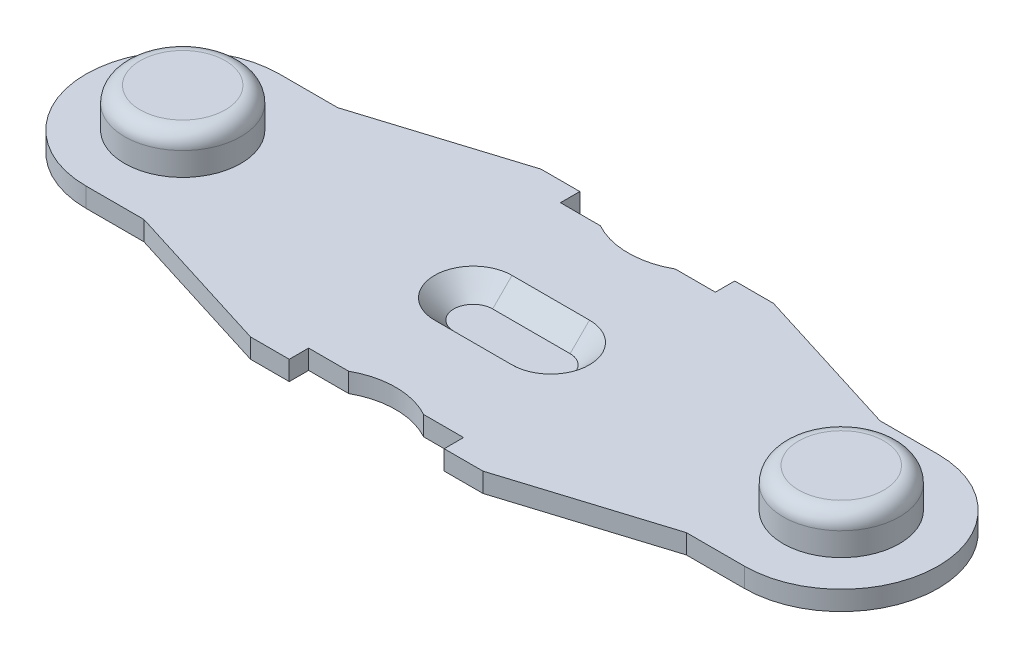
ISO-10303-21;
HEADER;
FILE_DESCRIPTION(('STEP AP214'),'2;1');
FILE_NAME('part.step','',(''),(''),'','','');
FILE_SCHEMA(('AUTOMOTIVE_DESIGN { 1 0 10303 214 1 1 1 1 }'));
ENDSEC;
DATA;
#1=APPLICATION_CONTEXT('core data for automotive mechanical design processes');
#2=APPLICATION_PROTOCOL_DEFINITION('international standard','automotive_design',2000,#1);
#3=PRODUCT_CONTEXT('',#1,'mechanical');
#4=PRODUCT('Part','Part','',(#3));
#5=PRODUCT_RELATED_PRODUCT_CATEGORY('part','',(#4));
#6=PRODUCT_DEFINITION_FORMATION('','',#4);
#7=PRODUCT_DEFINITION_CONTEXT('part definition',#1,'design');
#8=PRODUCT_DEFINITION('design','',#6,#7);
#9=PRODUCT_DEFINITION_SHAPE('','',#8);
#10=(LENGTH_UNIT() NAMED_UNIT(*) SI_UNIT(.MILLI.,.METRE.));
#11=(NAMED_UNIT(*) PLANE_ANGLE_UNIT() SI_UNIT($,.RADIAN.));
#12=(NAMED_UNIT(*) SI_UNIT($,.STERADIAN.) SOLID_ANGLE_UNIT());
#13=UNCERTAINTY_MEASURE_WITH_UNIT(LENGTH_MEASURE(1.E-05),#10,'distance_accuracy_value','');
#14=(GEOMETRIC_REPRESENTATION_CONTEXT(3) GLOBAL_UNCERTAINTY_ASSIGNED_CONTEXT((#13)) GLOBAL_UNIT_ASSIGNED_CONTEXT((#10,
#11,#12)) REPRESENTATION_CONTEXT('',''));
#15=CARTESIAN_POINT('',(0.,0.,0.));
#16=DIRECTION('',(0.,0.,1.));
#17=DIRECTION('',(1.,0.,0.));
#18=AXIS2_PLACEMENT_3D('',#15,#16,#17);
#19=CARTESIAN_POINT('',(8.5,-0.5,0.));
#20=DIRECTION('',(0.,1.,0.));
#21=DIRECTION('',(0.,0.,1.));
#22=AXIS2_PLACEMENT_3D('',#19,#20,#21);
#23=PLANE('',#22);
#24=CARTESIAN_POINT('',(8.5,-0.5,0.));
#25=DIRECTION('',(0.,1.,0.));
#26=DIRECTION('',(0.,0.,1.));
#27=AXIS2_PLACEMENT_3D('',#24,#25,#26);
#28=CIRCLE('',#27,1.25);
#29=CARTESIAN_POINT('',(8.5,-0.5,1.25));
#30=VERTEX_POINT('',#29);
#31=EDGE_CURVE('E36',#30,#30,#28,.F.);
#32=ORIENTED_EDGE('',*,*,#31,.F.);
#33=EDGE_LOOP('',(#32));
#34=FACE_BOUND('',#33,.T.);
#35=DIRECTION('',(1.,0.,0.));
#36=VECTOR('',#35,1.);
#37=CARTESIAN_POINT('',(8.5,-0.5,1.));
#38=LINE('',#37,#36);
#39=CARTESIAN_POINT('',(-1.,-0.5,1.));
#40=VERTEX_POINT('',#39);
#41=CARTESIAN_POINT('',(1.,-0.5,1.));
#42=VERTEX_POINT('',#41);
#43=EDGE_CURVE('E278',#40,#42,#38,.T.);
#44=ORIENTED_EDGE('',*,*,#43,.T.);
#45=CARTESIAN_POINT('',(1.,-0.5,0.));
#46=DIRECTION('',(0.,1.,0.));
#47=DIRECTION('',(0.,0.,1.));
#48=AXIS2_PLACEMENT_3D('',#45,#46,#47);
#49=CIRCLE('',#48,1.);
#50=CARTESIAN_POINT('',(1.,-0.5,-1.));
#51=VERTEX_POINT('',#50);
#52=EDGE_CURVE('E280',#42,#51,#49,.T.);
#53=ORIENTED_EDGE('',*,*,#52,.T.);
#54=DIRECTION('',(-1.,0.,0.));
#55=VECTOR('',#54,1.);
#56=CARTESIAN_POINT('',(8.5,-0.5,-1.));
#57=LINE('',#56,#55);
#58=CARTESIAN_POINT('',(-0.999999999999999,-0.5,-1.));
#59=VERTEX_POINT('',#58);
#60=EDGE_CURVE('E273',#51,#59,#57,.T.);
#61=ORIENTED_EDGE('',*,*,#60,.T.);
#62=CARTESIAN_POINT('',(-1.,-0.5,0.));
#63=DIRECTION('',(0.,1.,0.));
#64=DIRECTION('',(0.,0.,1.));
#65=AXIS2_PLACEMENT_3D('',#62,#63,#64);
#66=CIRCLE('',#65,1.);
#67=EDGE_CURVE('E276',#59,#40,#66,.T.);
#68=ORIENTED_EDGE('',*,*,#67,.T.);
#69=EDGE_LOOP('',(#44,#53,#61,#68));
#70=FACE_BOUND('',#69,.T.);
#71=CARTESIAN_POINT('',(8.5,-0.5,0.));
#72=DIRECTION('',(0.,1.,0.));
#73=DIRECTION('',(0.,0.,1.));
#74=AXIS2_PLACEMENT_3D('',#71,#72,#73);
#75=CIRCLE('',#74,2.5);
#76=CARTESIAN_POINT('',(8.5,-0.5,2.5));
#77=VERTEX_POINT('',#76);
#78=CARTESIAN_POINT('',(8.5,-0.5,-2.5));
#79=VERTEX_POINT('',#78);
#80=EDGE_CURVE('E354',#77,#79,#75,.T.);
#81=ORIENTED_EDGE('',*,*,#80,.F.);
#82=DIRECTION('',(1.,0.,0.));
#83=VECTOR('',#82,1.);
#84=CARTESIAN_POINT('',(7.,-0.5,2.5));
#85=LINE('',#84,#83);
#86=CARTESIAN_POINT('',(7.,-0.5,2.5));
#87=VERTEX_POINT('',#86);
#88=EDGE_CURVE('E423',#87,#77,#85,.T.);
#89=ORIENTED_EDGE('',*,*,#88,.F.);
#90=DIRECTION('',(0.95447997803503,0.,-0.298274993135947));
#91=VECTOR('',#90,1.);
#92=CARTESIAN_POINT('',(3.,-0.5,3.75));
#93=LINE('',#92,#91);
#94=CARTESIAN_POINT('',(3.,-0.5,3.75));
#95=VERTEX_POINT('',#94);
#96=EDGE_CURVE('E420',#95,#87,#93,.T.);
#97=ORIENTED_EDGE('',*,*,#96,.F.);
#98=DIRECTION('',(1.,0.,0.));
#99=VECTOR('',#98,1.);
#100=CARTESIAN_POINT('',(3.,-0.5,3.75));
#101=LINE('',#100,#99);
#102=CARTESIAN_POINT('',(2.,-0.5,3.75));
#103=VERTEX_POINT('',#102);
#104=EDGE_CURVE('E417',#103,#95,#101,.T.);
#105=ORIENTED_EDGE('',*,*,#104,.F.);
#106=DIRECTION('',(0.,0.,1.));
#107=VECTOR('',#106,1.);
#108=CARTESIAN_POINT('',(2.,-0.5,3.25));
#109=LINE('',#108,#107);
#110=CARTESIAN_POINT('',(2.,-0.5,3.25));
#111=VERTEX_POINT('',#110);
#112=EDGE_CURVE('E414',#111,#103,#109,.T.);
#113=ORIENTED_EDGE('',*,*,#112,.F.);
#114=DIRECTION('',(1.,0.,0.));
#115=VECTOR('',#114,1.);
#116=CARTESIAN_POINT('',(0.968245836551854,-0.5,3.25));
#117=LINE('',#116,#115);
#118=CARTESIAN_POINT('',(0.968245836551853,-0.5,3.25));
#119=VERTEX_POINT('',#118);
#120=EDGE_CURVE('E411',#119,#111,#117,.T.);
#121=ORIENTED_EDGE('',*,*,#120,.F.);
#122=CARTESIAN_POINT('',(0.,-0.5,5.));
#123=DIRECTION('',(0.,-1.,0.));
#124=DIRECTION('',(0.,0.,-1.));
#125=AXIS2_PLACEMENT_3D('',#122,#123,#124);
#126=CIRCLE('',#125,2.);
#127=CARTESIAN_POINT('',(-0.968245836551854,-0.5,3.25));
#128=VERTEX_POINT('',#127);
#129=EDGE_CURVE('E408',#128,#119,#126,.T.);
#130=ORIENTED_EDGE('',*,*,#129,.F.);
#131=DIRECTION('',(1.,0.,0.));
#132=VECTOR('',#131,1.);
#133=CARTESIAN_POINT('',(-0.968245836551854,-0.5,3.25));
#134=LINE('',#133,#132);
#135=CARTESIAN_POINT('',(-2.,-0.5,3.25));
#136=VERTEX_POINT('',#135);
#137=EDGE_CURVE('E405',#136,#128,#134,.T.);
#138=ORIENTED_EDGE('',*,*,#137,.F.);
#139=DIRECTION('',(0.,0.,-1.));
#140=VECTOR('',#139,1.);
#141=CARTESIAN_POINT('',(-2.,-0.5,3.25));
#142=LINE('',#141,#140);
#143=CARTESIAN_POINT('',(-2.,-0.5,3.75));
#144=VERTEX_POINT('',#143);
#145=EDGE_CURVE('E402',#144,#136,#142,.T.);
#146=ORIENTED_EDGE('',*,*,#145,.F.);
#147=DIRECTION('',(1.,0.,0.));
#148=VECTOR('',#147,1.);
#149=CARTESIAN_POINT('',(-3.,-0.5,3.75));
#150=LINE('',#149,#148);
#151=CARTESIAN_POINT('',(-3.,-0.5,3.75));
#152=VERTEX_POINT('',#151);
#153=EDGE_CURVE('E399',#152,#144,#150,.T.);
#154=ORIENTED_EDGE('',*,*,#153,.F.);
#155=DIRECTION('',(0.95447997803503,0.,0.298274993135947));
#156=VECTOR('',#155,1.);
#157=CARTESIAN_POINT('',(-3.,-0.5,3.75));
#158=LINE('',#157,#156);
#159=CARTESIAN_POINT('',(-7.,-0.5,2.5));
#160=VERTEX_POINT('',#159);
#161=EDGE_CURVE('E396',#160,#152,#158,.T.);
#162=ORIENTED_EDGE('',*,*,#161,.F.);
#163=DIRECTION('',(1.,0.,0.));
#164=VECTOR('',#163,1.);
#165=CARTESIAN_POINT('',(-7.,-0.5,2.5));
#166=LINE('',#165,#164);
#167=CARTESIAN_POINT('',(-8.5,-0.5,2.5));
#168=VERTEX_POINT('',#167);
#169=EDGE_CURVE('E393',#168,#160,#166,.T.);
#170=ORIENTED_EDGE('',*,*,#169,.F.);
#171=CARTESIAN_POINT('',(-8.5,-0.5,0.));
#172=DIRECTION('',(0.,1.,0.));
#173=DIRECTION('',(0.,0.,-1.));
#174=AXIS2_PLACEMENT_3D('',#171,#172,#173);
#175=CIRCLE('',#174,2.5);
#176=CARTESIAN_POINT('',(-8.5,-0.5,-2.5));
#177=VERTEX_POINT('',#176);
#178=EDGE_CURVE('E390',#177,#168,#175,.T.);
#179=ORIENTED_EDGE('',*,*,#178,.F.);
#180=DIRECTION('',(-1.,0.,0.));
#181=VECTOR('',#180,1.);
#182=CARTESIAN_POINT('',(-7.,-0.5,-2.5));
#183=LINE('',#182,#181);
#184=CARTESIAN_POINT('',(-7.,-0.5,-2.5));
#185=VERTEX_POINT('',#184);
#186=EDGE_CURVE('E387',#185,#177,#183,.T.);
#187=ORIENTED_EDGE('',*,*,#186,.F.);
#188=DIRECTION('',(-0.95447997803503,0.,0.298274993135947));
#189=VECTOR('',#188,1.);
#190=CARTESIAN_POINT('',(-3.,-0.5,-3.75));
#191=LINE('',#190,#189);
#192=CARTESIAN_POINT('',(-3.,-0.5,-3.75));
#193=VERTEX_POINT('',#192);
#194=EDGE_CURVE('E384',#193,#185,#191,.T.);
#195=ORIENTED_EDGE('',*,*,#194,.F.);
#196=DIRECTION('',(-1.,0.,0.));
#197=VECTOR('',#196,1.);
#198=CARTESIAN_POINT('',(-3.,-0.5,-3.75));
#199=LINE('',#198,#197);
#200=CARTESIAN_POINT('',(-2.,-0.5,-3.75));
#201=VERTEX_POINT('',#200);
#202=EDGE_CURVE('E381',#201,#193,#199,.T.);
#203=ORIENTED_EDGE('',*,*,#202,.F.);
#204=DIRECTION('',(0.,0.,-1.));
#205=VECTOR('',#204,1.);
#206=CARTESIAN_POINT('',(-2.,-0.5,-3.25));
#207=LINE('',#206,#205);
#208=CARTESIAN_POINT('',(-2.,-0.5,-3.25));
#209=VERTEX_POINT('',#208);
#210=EDGE_CURVE('E378',#209,#201,#207,.T.);
#211=ORIENTED_EDGE('',*,*,#210,.F.);
#212=DIRECTION('',(-1.,0.,0.));
#213=VECTOR('',#212,1.);
#214=CARTESIAN_POINT('',(-0.968245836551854,-0.5,-3.25));
#215=LINE('',#214,#213);
#216=CARTESIAN_POINT('',(-0.968245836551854,-0.5,-3.25));
#217=VERTEX_POINT('',#216);
#218=EDGE_CURVE('E375',#217,#209,#215,.T.);
#219=ORIENTED_EDGE('',*,*,#218,.F.);
#220=CARTESIAN_POINT('',(0.,-0.5,-5.));
#221=DIRECTION('',(0.,-1.,0.));
#222=DIRECTION('',(0.,0.,1.));
#223=AXIS2_PLACEMENT_3D('',#220,#221,#222);
#224=CIRCLE('',#223,2.);
#225=CARTESIAN_POINT('',(0.968245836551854,-0.5,-3.25));
#226=VERTEX_POINT('',#225);
#227=EDGE_CURVE('E372',#226,#217,#224,.T.);
#228=ORIENTED_EDGE('',*,*,#227,.F.);
#229=DIRECTION('',(-1.,0.,0.));
#230=VECTOR('',#229,1.);
#231=CARTESIAN_POINT('',(0.968245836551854,-0.5,-3.25));
#232=LINE('',#231,#230);
#233=CARTESIAN_POINT('',(2.,-0.5,-3.25));
#234=VERTEX_POINT('',#233);
#235=EDGE_CURVE('E369',#234,#226,#232,.T.);
#236=ORIENTED_EDGE('',*,*,#235,.F.);
#237=DIRECTION('',(0.,0.,1.));
#238=VECTOR('',#237,1.);
#239=CARTESIAN_POINT('',(2.,-0.5,-3.25));
#240=LINE('',#239,#238);
#241=CARTESIAN_POINT('',(2.,-0.5,-3.75));
#242=VERTEX_POINT('',#241);
#243=EDGE_CURVE('E366',#242,#234,#240,.T.);
#244=ORIENTED_EDGE('',*,*,#243,.F.);
#245=DIRECTION('',(-1.,0.,0.));
#246=VECTOR('',#245,1.);
#247=CARTESIAN_POINT('',(3.,-0.5,-3.75));
#248=LINE('',#247,#246);
#249=CARTESIAN_POINT('',(3.,-0.5,-3.75));
#250=VERTEX_POINT('',#249);
#251=EDGE_CURVE('E363',#250,#242,#248,.T.);
#252=ORIENTED_EDGE('',*,*,#251,.F.);
#253=DIRECTION('',(-0.95447997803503,0.,-0.298274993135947));
#254=VECTOR('',#253,1.);
#255=CARTESIAN_POINT('',(3.,-0.5,-3.75));
#256=LINE('',#255,#254);
#257=CARTESIAN_POINT('',(7.,-0.5,-2.5));
#258=VERTEX_POINT('',#257);
#259=EDGE_CURVE('E360',#258,#250,#256,.T.);
#260=ORIENTED_EDGE('',*,*,#259,.F.);
#261=DIRECTION('',(-1.,0.,0.));
#262=VECTOR('',#261,1.);
#263=CARTESIAN_POINT('',(7.,-0.5,-2.5));
#264=LINE('',#263,#262);
#265=EDGE_CURVE('E357',#79,#258,#264,.T.);
#266=ORIENTED_EDGE('',*,*,#265,.F.);
#267=EDGE_LOOP('',(#81,#89,#97,#105,#113,#121,#130,#138,#146,#154,#162,#170,#179,#187,#195,#203,
#211,#219,#228,#236,#244,#252,#260,#266));
#268=FACE_BOUND('',#267,.T.);
#269=CARTESIAN_POINT('',(-8.5,-0.5,0.));
#270=DIRECTION('',(0.,1.,0.));
#271=DIRECTION('',(0.,0.,1.));
#272=AXIS2_PLACEMENT_3D('',#269,#270,#271);
#273=CIRCLE('',#272,1.25);
#274=CARTESIAN_POINT('',(-8.5,-0.5,1.25));
#275=VERTEX_POINT('',#274);
#276=EDGE_CURVE('E11',#275,#275,#273,.F.);
#277=ORIENTED_EDGE('',*,*,#276,.F.);
#278=EDGE_LOOP('',(#277));
#279=FACE_BOUND('',#278,.T.);
#280=ADVANCED_FACE('F28',(#34,#70,#268,#279),#23,.F.);
#281=CARTESIAN_POINT('',(8.5,0.,0.));
#282=DIRECTION('',(0.,1.,0.));
#283=DIRECTION('',(0.,0.,1.));
#284=AXIS2_PLACEMENT_3D('',#281,#282,#283);
#285=PLANE('',#284);
#286=CARTESIAN_POINT('',(8.5,0.,0.));
#287=DIRECTION('',(0.,1.,0.));
#288=DIRECTION('',(0.,0.,1.));
#289=AXIS2_PLACEMENT_3D('',#286,#287,#288);
#290=CIRCLE('',#289,1.5);
#291=CARTESIAN_POINT('',(8.5,0.,1.5));
#292=VERTEX_POINT('',#291);
#293=EDGE_CURVE('E975',#292,#292,#290,.T.);
#294=ORIENTED_EDGE('',*,*,#293,.F.);
#295=EDGE_LOOP('',(#294));
#296=FACE_BOUND('',#295,.T.);
#297=CARTESIAN_POINT('',(1.,0.,0.));
#298=DIRECTION('',(0.,1.,0.));
#299=DIRECTION('',(0.,0.,1.));
#300=AXIS2_PLACEMENT_3D('',#297,#298,#299);
#301=CIRCLE('',#300,1.00000000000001);
#302=CARTESIAN_POINT('',(1.,0.,-1.00000000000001));
#303=VERTEX_POINT('',#302);
#304=CARTESIAN_POINT('',(1.,0.,1.00000000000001));
#305=VERTEX_POINT('',#304);
#306=EDGE_CURVE('E43',#303,#305,#301,.F.);
#307=ORIENTED_EDGE('',*,*,#306,.T.);
#308=DIRECTION('',(-1.,0.,0.));
#309=VECTOR('',#308,1.);
#310=CARTESIAN_POINT('',(-0.999999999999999,0.,1.00000000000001));
#311=LINE('',#310,#309);
#312=CARTESIAN_POINT('',(-1.,0.,1.00000000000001));
#313=VERTEX_POINT('',#312);
#314=EDGE_CURVE('E487',#305,#313,#311,.T.);
#315=ORIENTED_EDGE('',*,*,#314,.T.);
#316=CARTESIAN_POINT('',(-1.,0.,0.));
#317=DIRECTION('',(0.,1.,0.));
#318=DIRECTION('',(0.,0.,1.));
#319=AXIS2_PLACEMENT_3D('',#316,#317,#318);
#320=CIRCLE('',#319,1.00000000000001);
#321=CARTESIAN_POINT('',(-0.999999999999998,0.,-1.00000000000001));
#322=VERTEX_POINT('',#321);
#323=EDGE_CURVE('E250',#313,#322,#320,.F.);
#324=ORIENTED_EDGE('',*,*,#323,.T.);
#325=DIRECTION('',(1.,0.,0.));
#326=VECTOR('',#325,1.);
#327=CARTESIAN_POINT('',(1.,0.,-1.00000000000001));
#328=LINE('',#327,#326);
#329=EDGE_CURVE('E483',#322,#303,#328,.T.);
#330=ORIENTED_EDGE('',*,*,#329,.T.);
#331=EDGE_LOOP('',(#307,#315,#324,#330));
#332=FACE_BOUND('',#331,.T.);
#333=CARTESIAN_POINT('',(8.5,0.,0.));
#334=DIRECTION('',(0.,1.,0.));
#335=DIRECTION('',(0.,0.,1.));
#336=AXIS2_PLACEMENT_3D('',#333,#334,#335);
#337=CIRCLE('',#336,2.5);
#338=CARTESIAN_POINT('',(8.5,0.,2.5));
#339=VERTEX_POINT('',#338);
#340=CARTESIAN_POINT('',(8.5,0.,-2.5));
#341=VERTEX_POINT('',#340);
#342=EDGE_CURVE('E282',#339,#341,#337,.T.);
#343=ORIENTED_EDGE('',*,*,#342,.T.);
#344=DIRECTION('',(-1.,0.,0.));
#345=VECTOR('',#344,1.);
#346=CARTESIAN_POINT('',(7.,0.,-2.5));
#347=LINE('',#346,#345);
#348=CARTESIAN_POINT('',(7.,0.,-2.5));
#349=VERTEX_POINT('',#348);
#350=EDGE_CURVE('E285',#341,#349,#347,.T.);
#351=ORIENTED_EDGE('',*,*,#350,.T.);
#352=DIRECTION('',(-0.95447997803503,0.,-0.298274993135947));
#353=VECTOR('',#352,1.);
#354=CARTESIAN_POINT('',(3.,0.,-3.75));
#355=LINE('',#354,#353);
#356=CARTESIAN_POINT('',(3.,0.,-3.75));
#357=VERTEX_POINT('',#356);
#358=EDGE_CURVE('E288',#349,#357,#355,.T.);
#359=ORIENTED_EDGE('',*,*,#358,.T.);
#360=DIRECTION('',(-1.,0.,0.));
#361=VECTOR('',#360,1.);
#362=CARTESIAN_POINT('',(3.,0.,-3.75));
#363=LINE('',#362,#361);
#364=CARTESIAN_POINT('',(2.,0.,-3.75));
#365=VERTEX_POINT('',#364);
#366=EDGE_CURVE('E291',#357,#365,#363,.T.);
#367=ORIENTED_EDGE('',*,*,#366,.T.);
#368=DIRECTION('',(0.,0.,1.));
#369=VECTOR('',#368,1.);
#370=CARTESIAN_POINT('',(2.,0.,-3.25));
#371=LINE('',#370,#369);
#372=CARTESIAN_POINT('',(2.,0.,-3.25));
#373=VERTEX_POINT('',#372);
#374=EDGE_CURVE('E294',#365,#373,#371,.T.);
#375=ORIENTED_EDGE('',*,*,#374,.T.);
#376=DIRECTION('',(-1.,0.,0.));
#377=VECTOR('',#376,1.);
#378=CARTESIAN_POINT('',(0.968245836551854,0.,-3.25));
#379=LINE('',#378,#377);
#380=CARTESIAN_POINT('',(0.968245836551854,0.,-3.25));
#381=VERTEX_POINT('',#380);
#382=EDGE_CURVE('E297',#373,#381,#379,.T.);
#383=ORIENTED_EDGE('',*,*,#382,.T.);
#384=CARTESIAN_POINT('',(0.,0.,-5.));
#385=DIRECTION('',(0.,-1.,0.));
#386=DIRECTION('',(0.,0.,1.));
#387=AXIS2_PLACEMENT_3D('',#384,#385,#386);
#388=CIRCLE('',#387,2.);
#389=CARTESIAN_POINT('',(-0.968245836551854,0.,-3.25));
#390=VERTEX_POINT('',#389);
#391=EDGE_CURVE('E300',#381,#390,#388,.T.);
#392=ORIENTED_EDGE('',*,*,#391,.T.);
#393=DIRECTION('',(-1.,0.,0.));
#394=VECTOR('',#393,1.);
#395=CARTESIAN_POINT('',(-0.968245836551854,0.,-3.25));
#396=LINE('',#395,#394);
#397=CARTESIAN_POINT('',(-2.,0.,-3.25));
#398=VERTEX_POINT('',#397);
#399=EDGE_CURVE('E303',#390,#398,#396,.T.);
#400=ORIENTED_EDGE('',*,*,#399,.T.);
#401=DIRECTION('',(0.,0.,-1.));
#402=VECTOR('',#401,1.);
#403=CARTESIAN_POINT('',(-2.,0.,-3.25));
#404=LINE('',#403,#402);
#405=CARTESIAN_POINT('',(-2.,0.,-3.75));
#406=VERTEX_POINT('',#405);
#407=EDGE_CURVE('E306',#398,#406,#404,.T.);
#408=ORIENTED_EDGE('',*,*,#407,.T.);
#409=DIRECTION('',(-1.,0.,0.));
#410=VECTOR('',#409,1.);
#411=CARTESIAN_POINT('',(-3.,0.,-3.75));
#412=LINE('',#411,#410);
#413=CARTESIAN_POINT('',(-3.,0.,-3.75));
#414=VERTEX_POINT('',#413);
#415=EDGE_CURVE('E309',#406,#414,#412,.T.);
#416=ORIENTED_EDGE('',*,*,#415,.T.);
#417=DIRECTION('',(-0.95447997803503,0.,0.298274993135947));
#418=VECTOR('',#417,1.);
#419=CARTESIAN_POINT('',(-3.,0.,-3.75));
#420=LINE('',#419,#418);
#421=CARTESIAN_POINT('',(-7.,0.,-2.5));
#422=VERTEX_POINT('',#421);
#423=EDGE_CURVE('E312',#414,#422,#420,.T.);
#424=ORIENTED_EDGE('',*,*,#423,.T.);
#425=DIRECTION('',(-1.,0.,0.));
#426=VECTOR('',#425,1.);
#427=CARTESIAN_POINT('',(-7.,0.,-2.5));
#428=LINE('',#427,#426);
#429=CARTESIAN_POINT('',(-8.5,0.,-2.5));
#430=VERTEX_POINT('',#429);
#431=EDGE_CURVE('E315',#422,#430,#428,.T.);
#432=ORIENTED_EDGE('',*,*,#431,.T.);
#433=CARTESIAN_POINT('',(-8.5,0.,0.));
#434=DIRECTION('',(0.,1.,0.));
#435=DIRECTION('',(0.,0.,-1.));
#436=AXIS2_PLACEMENT_3D('',#433,#434,#435);
#437=CIRCLE('',#436,2.5);
#438=CARTESIAN_POINT('',(-8.5,0.,2.5));
#439=VERTEX_POINT('',#438);
#440=EDGE_CURVE('E318',#430,#439,#437,.T.);
#441=ORIENTED_EDGE('',*,*,#440,.T.);
#442=DIRECTION('',(1.,0.,0.));
#443=VECTOR('',#442,1.);
#444=CARTESIAN_POINT('',(-7.,0.,2.5));
#445=LINE('',#444,#443);
#446=CARTESIAN_POINT('',(-7.,0.,2.5));
#447=VERTEX_POINT('',#446);
#448=EDGE_CURVE('E321',#439,#447,#445,.T.);
#449=ORIENTED_EDGE('',*,*,#448,.T.);
#450=DIRECTION('',(0.95447997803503,0.,0.298274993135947));
#451=VECTOR('',#450,1.);
#452=CARTESIAN_POINT('',(-3.,0.,3.75));
#453=LINE('',#452,#451);
#454=CARTESIAN_POINT('',(-3.,0.,3.75));
#455=VERTEX_POINT('',#454);
#456=EDGE_CURVE('E324',#447,#455,#453,.T.);
#457=ORIENTED_EDGE('',*,*,#456,.T.);
#458=DIRECTION('',(1.,0.,0.));
#459=VECTOR('',#458,1.);
#460=CARTESIAN_POINT('',(-3.,0.,3.75));
#461=LINE('',#460,#459);
#462=CARTESIAN_POINT('',(-2.,0.,3.75));
#463=VERTEX_POINT('',#462);
#464=EDGE_CURVE('E327',#455,#463,#461,.T.);
#465=ORIENTED_EDGE('',*,*,#464,.T.);
#466=DIRECTION('',(0.,0.,-1.));
#467=VECTOR('',#466,1.);
#468=CARTESIAN_POINT('',(-2.,0.,3.25));
#469=LINE('',#468,#467);
#470=CARTESIAN_POINT('',(-2.,0.,3.25));
#471=VERTEX_POINT('',#470);
#472=EDGE_CURVE('E330',#463,#471,#469,.T.);
#473=ORIENTED_EDGE('',*,*,#472,.T.);
#474=DIRECTION('',(1.,0.,0.));
#475=VECTOR('',#474,1.);
#476=CARTESIAN_POINT('',(-0.968245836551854,0.,3.25));
#477=LINE('',#476,#475);
#478=CARTESIAN_POINT('',(-0.968245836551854,0.,3.25));
#479=VERTEX_POINT('',#478);
#480=EDGE_CURVE('E333',#471,#479,#477,.T.);
#481=ORIENTED_EDGE('',*,*,#480,.T.);
#482=CARTESIAN_POINT('',(0.,0.,5.));
#483=DIRECTION('',(0.,-1.,0.));
#484=DIRECTION('',(0.,0.,-1.));
#485=AXIS2_PLACEMENT_3D('',#482,#483,#484);
#486=CIRCLE('',#485,2.);
#487=CARTESIAN_POINT('',(0.968245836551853,0.,3.25));
#488=VERTEX_POINT('',#487);
#489=EDGE_CURVE('E336',#479,#488,#486,.T.);
#490=ORIENTED_EDGE('',*,*,#489,.T.);
#491=DIRECTION('',(1.,0.,0.));
#492=VECTOR('',#491,1.);
#493=CARTESIAN_POINT('',(0.968245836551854,0.,3.25));
#494=LINE('',#493,#492);
#495=CARTESIAN_POINT('',(2.,0.,3.25));
#496=VERTEX_POINT('',#495);
#497=EDGE_CURVE('E339',#488,#496,#494,.T.);
#498=ORIENTED_EDGE('',*,*,#497,.T.);
#499=DIRECTION('',(0.,0.,1.));
#500=VECTOR('',#499,1.);
#501=CARTESIAN_POINT('',(2.,0.,3.25));
#502=LINE('',#501,#500);
#503=CARTESIAN_POINT('',(2.,0.,3.75));
#504=VERTEX_POINT('',#503);
#505=EDGE_CURVE('E342',#496,#504,#502,.T.);
#506=ORIENTED_EDGE('',*,*,#505,.T.);
#507=DIRECTION('',(1.,0.,0.));
#508=VECTOR('',#507,1.);
#509=CARTESIAN_POINT('',(3.,0.,3.75));
#510=LINE('',#509,#508);
#511=CARTESIAN_POINT('',(3.,0.,3.75));
#512=VERTEX_POINT('',#511);
#513=EDGE_CURVE('E345',#504,#512,#510,.T.);
#514=ORIENTED_EDGE('',*,*,#513,.T.);
#515=DIRECTION('',(0.95447997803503,0.,-0.298274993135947));
#516=VECTOR('',#515,1.);
#517=CARTESIAN_POINT('',(3.,0.,3.75));
#518=LINE('',#517,#516);
#519=CARTESIAN_POINT('',(7.,0.,2.5));
#520=VERTEX_POINT('',#519);
#521=EDGE_CURVE('E348',#512,#520,#518,.T.);
#522=ORIENTED_EDGE('',*,*,#521,.T.);
#523=DIRECTION('',(1.,0.,0.));
#524=VECTOR('',#523,1.);
#525=CARTESIAN_POINT('',(7.,0.,2.5));
#526=LINE('',#525,#524);
#527=EDGE_CURVE('E351',#520,#339,#526,.T.);
#528=ORIENTED_EDGE('',*,*,#527,.T.);
#529=EDGE_LOOP('',(#343,#351,#359,#367,#375,#383,#392,#400,#408,#416,#424,#432,#441,#449,#457,
#465,#473,#481,#490,#498,#506,#514,#522,#528));
#530=FACE_BOUND('',#529,.T.);
#531=CARTESIAN_POINT('',(-8.5,0.,0.));
#532=DIRECTION('',(0.,1.,0.));
#533=DIRECTION('',(0.,0.,1.));
#534=AXIS2_PLACEMENT_3D('',#531,#532,#533);
#535=CIRCLE('',#534,1.5);
#536=CARTESIAN_POINT('',(-8.5,0.,1.5));
#537=VERTEX_POINT('',#536);
#538=EDGE_CURVE('E973',#537,#537,#535,.T.);
#539=ORIENTED_EDGE('',*,*,#538,.F.);
#540=EDGE_LOOP('',(#539));
#541=FACE_BOUND('',#540,.T.);
#542=ADVANCED_FACE('F507',(#296,#332,#530,#541),#285,.T.);
#543=CARTESIAN_POINT('',(8.5,-0.5,0.));
#544=DIRECTION('',(0.,1.,0.));
#545=DIRECTION('',(0.,0.,1.));
#546=AXIS2_PLACEMENT_3D('',#543,#544,#545);
#547=CYLINDRICAL_SURFACE('',#546,2.5);
#548=ORIENTED_EDGE('',*,*,#342,.F.);
#549=DIRECTION('',(0.,1.,0.));
#550=VECTOR('',#549,1.);
#551=CARTESIAN_POINT('',(8.5,-0.5,2.5));
#552=LINE('',#551,#550);
#553=EDGE_CURVE('E427',#77,#339,#552,.T.);
#554=ORIENTED_EDGE('',*,*,#553,.F.);
#555=ORIENTED_EDGE('',*,*,#80,.T.);
#556=DIRECTION('',(0.,1.,0.));
#557=VECTOR('',#556,1.);
#558=CARTESIAN_POINT('',(8.5,-0.5,-2.5));
#559=LINE('',#558,#557);
#560=EDGE_CURVE('E426',#79,#341,#559,.T.);
#561=ORIENTED_EDGE('',*,*,#560,.T.);
#562=EDGE_LOOP('',(#548,#554,#555,#561));
#563=FACE_BOUND('',#562,.T.);
#564=ADVANCED_FACE('F30',(#563),#547,.T.);
#565=CARTESIAN_POINT('',(7.,-0.5,2.5));
#566=DIRECTION('',(0.,0.,1.));
#567=DIRECTION('',(1.,0.,0.));
#568=AXIS2_PLACEMENT_3D('',#565,#566,#567);
#569=PLANE('',#568);
#570=ORIENTED_EDGE('',*,*,#527,.F.);
#571=DIRECTION('',(0.,1.,0.));
#572=VECTOR('',#571,1.);
#573=CARTESIAN_POINT('',(7.,-0.5,2.5));
#574=LINE('',#573,#572);
#575=EDGE_CURVE('E430',#87,#520,#574,.T.);
#576=ORIENTED_EDGE('',*,*,#575,.F.);
#577=ORIENTED_EDGE('',*,*,#88,.T.);
#578=ORIENTED_EDGE('',*,*,#553,.T.);
#579=EDGE_LOOP('',(#570,#576,#577,#578));
#580=FACE_BOUND('',#579,.T.);
#581=ADVANCED_FACE('F599',(#580),#569,.T.);
#582=CARTESIAN_POINT('',(3.,-0.5,3.75));
#583=DIRECTION('',(0.298274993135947,0.,0.95447997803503));
#584=DIRECTION('',(0.95447997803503,0.,-0.298274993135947));
#585=AXIS2_PLACEMENT_3D('',#582,#583,#584);
#586=PLANE('',#585);
#587=ORIENTED_EDGE('',*,*,#521,.F.);
#588=DIRECTION('',(0.,1.,0.));
#589=VECTOR('',#588,1.);
#590=CARTESIAN_POINT('',(3.,-0.5,3.75));
#591=LINE('',#590,#589);
#592=EDGE_CURVE('E432',#95,#512,#591,.T.);
#593=ORIENTED_EDGE('',*,*,#592,.F.);
#594=ORIENTED_EDGE('',*,*,#96,.T.);
#595=ORIENTED_EDGE('',*,*,#575,.T.);
#596=EDGE_LOOP('',(#587,#593,#594,#595));
#597=FACE_BOUND('',#596,.T.);
#598=ADVANCED_FACE('F602',(#597),#586,.T.);
#599=CARTESIAN_POINT('',(3.,-0.5,3.75));
#600=DIRECTION('',(0.,0.,1.));
#601=DIRECTION('',(1.,0.,0.));
#602=AXIS2_PLACEMENT_3D('',#599,#600,#601);
#603=PLANE('',#602);
#604=ORIENTED_EDGE('',*,*,#513,.F.);
#605=DIRECTION('',(0.,1.,0.));
#606=VECTOR('',#605,1.);
#607=CARTESIAN_POINT('',(2.,-0.5,3.75));
#608=LINE('',#607,#606);
#609=EDGE_CURVE('E434',#103,#504,#608,.T.);
#610=ORIENTED_EDGE('',*,*,#609,.F.);
#611=ORIENTED_EDGE('',*,*,#104,.T.);
#612=ORIENTED_EDGE('',*,*,#592,.T.);
#613=EDGE_LOOP('',(#604,#610,#611,#612));
#614=FACE_BOUND('',#613,.T.);
#615=ADVANCED_FACE('F606',(#614),#603,.T.);
#616=CARTESIAN_POINT('',(2.,-0.5,3.25));
#617=DIRECTION('',(-1.,0.,0.));
#618=DIRECTION('',(0.,0.,1.));
#619=AXIS2_PLACEMENT_3D('',#616,#617,#618);
#620=PLANE('',#619);
#621=ORIENTED_EDGE('',*,*,#505,.F.);
#622=DIRECTION('',(0.,1.,0.));
#623=VECTOR('',#622,1.);
#624=CARTESIAN_POINT('',(2.,-0.5,3.25));
#625=LINE('',#624,#623);
#626=EDGE_CURVE('E436',#111,#496,#625,.T.);
#627=ORIENTED_EDGE('',*,*,#626,.F.);
#628=ORIENTED_EDGE('',*,*,#112,.T.);
#629=ORIENTED_EDGE('',*,*,#609,.T.);
#630=EDGE_LOOP('',(#621,#627,#628,#629));
#631=FACE_BOUND('',#630,.T.);
#632=ADVANCED_FACE('F610',(#631),#620,.T.);
#633=CARTESIAN_POINT('',(0.968245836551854,-0.5,3.25));
#634=DIRECTION('',(0.,0.,1.));
#635=DIRECTION('',(1.,0.,0.));
#636=AXIS2_PLACEMENT_3D('',#633,#634,#635);
#637=PLANE('',#636);
#638=ORIENTED_EDGE('',*,*,#497,.F.);
#639=DIRECTION('',(0.,1.,0.));
#640=VECTOR('',#639,1.);
#641=CARTESIAN_POINT('',(0.968245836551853,-0.5,3.25));
#642=LINE('',#641,#640);
#643=EDGE_CURVE('E438',#119,#488,#642,.T.);
#644=ORIENTED_EDGE('',*,*,#643,.F.);
#645=ORIENTED_EDGE('',*,*,#120,.T.);
#646=ORIENTED_EDGE('',*,*,#626,.T.);
#647=EDGE_LOOP('',(#638,#644,#645,#646));
#648=FACE_BOUND('',#647,.T.);
#649=ADVANCED_FACE('F614',(#648),#637,.T.);
#650=CARTESIAN_POINT('',(0.,-0.5,5.));
#651=DIRECTION('',(0.,1.,0.));
#652=DIRECTION('',(0.,0.,1.));
#653=AXIS2_PLACEMENT_3D('',#650,#651,#652);
#654=CYLINDRICAL_SURFACE('',#653,2.);
#655=ORIENTED_EDGE('',*,*,#489,.F.);
#656=DIRECTION('',(0.,1.,0.));
#657=VECTOR('',#656,1.);
#658=CARTESIAN_POINT('',(-0.968245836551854,-0.5,3.25));
#659=LINE('',#658,#657);
#660=EDGE_CURVE('E440',#128,#479,#659,.T.);
#661=ORIENTED_EDGE('',*,*,#660,.F.);
#662=ORIENTED_EDGE('',*,*,#129,.T.);
#663=ORIENTED_EDGE('',*,*,#643,.T.);
#664=EDGE_LOOP('',(#655,#661,#662,#663));
#665=FACE_BOUND('',#664,.T.);
#666=ADVANCED_FACE('F618',(#665),#654,.F.);
#667=CARTESIAN_POINT('',(-0.968245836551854,-0.5,3.25));
#668=DIRECTION('',(0.,0.,1.));
#669=DIRECTION('',(1.,0.,0.));
#670=AXIS2_PLACEMENT_3D('',#667,#668,#669);
#671=PLANE('',#670);
#672=ORIENTED_EDGE('',*,*,#480,.F.);
#673=DIRECTION('',(0.,1.,0.));
#674=VECTOR('',#673,1.);
#675=CARTESIAN_POINT('',(-2.,-0.5,3.25));
#676=LINE('',#675,#674);
#677=EDGE_CURVE('E442',#136,#471,#676,.T.);
#678=ORIENTED_EDGE('',*,*,#677,.F.);
#679=ORIENTED_EDGE('',*,*,#137,.T.);
#680=ORIENTED_EDGE('',*,*,#660,.T.);
#681=EDGE_LOOP('',(#672,#678,#679,#680));
#682=FACE_BOUND('',#681,.T.);
#683=ADVANCED_FACE('F622',(#682),#671,.T.);
#684=CARTESIAN_POINT('',(-2.,-0.5,3.25));
#685=DIRECTION('',(1.,0.,0.));
#686=DIRECTION('',(0.,0.,-1.));
#687=AXIS2_PLACEMENT_3D('',#684,#685,#686);
#688=PLANE('',#687);
#689=ORIENTED_EDGE('',*,*,#472,.F.);
#690=DIRECTION('',(0.,1.,0.));
#691=VECTOR('',#690,1.);
#692=CARTESIAN_POINT('',(-2.,-0.5,3.75));
#693=LINE('',#692,#691);
#694=EDGE_CURVE('E444',#144,#463,#693,.T.);
#695=ORIENTED_EDGE('',*,*,#694,.F.);
#696=ORIENTED_EDGE('',*,*,#145,.T.);
#697=ORIENTED_EDGE('',*,*,#677,.T.);
#698=EDGE_LOOP('',(#689,#695,#696,#697));
#699=FACE_BOUND('',#698,.T.);
#700=ADVANCED_FACE('F626',(#699),#688,.T.);
#701=CARTESIAN_POINT('',(-3.,-0.5,3.75));
#702=DIRECTION('',(0.,0.,1.));
#703=DIRECTION('',(1.,0.,0.));
#704=AXIS2_PLACEMENT_3D('',#701,#702,#703);
#705=PLANE('',#704);
#706=ORIENTED_EDGE('',*,*,#464,.F.);
#707=DIRECTION('',(0.,1.,0.));
#708=VECTOR('',#707,1.);
#709=CARTESIAN_POINT('',(-3.,-0.5,3.75));
#710=LINE('',#709,#708);
#711=EDGE_CURVE('E446',#152,#455,#710,.T.);
#712=ORIENTED_EDGE('',*,*,#711,.F.);
#713=ORIENTED_EDGE('',*,*,#153,.T.);
#714=ORIENTED_EDGE('',*,*,#694,.T.);
#715=EDGE_LOOP('',(#706,#712,#713,#714));
#716=FACE_BOUND('',#715,.T.);
#717=ADVANCED_FACE('F630',(#716),#705,.T.);
#718=CARTESIAN_POINT('',(-3.,-0.5,3.75));
#719=DIRECTION('',(-0.298274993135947,0.,0.95447997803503));
#720=DIRECTION('',(0.95447997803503,0.,0.298274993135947));
#721=AXIS2_PLACEMENT_3D('',#718,#719,#720);
#722=PLANE('',#721);
#723=ORIENTED_EDGE('',*,*,#456,.F.);
#724=DIRECTION('',(0.,1.,0.));
#725=VECTOR('',#724,1.);
#726=CARTESIAN_POINT('',(-7.,-0.5,2.5));
#727=LINE('',#726,#725);
#728=EDGE_CURVE('E448',#160,#447,#727,.T.);
#729=ORIENTED_EDGE('',*,*,#728,.F.);
#730=ORIENTED_EDGE('',*,*,#161,.T.);
#731=ORIENTED_EDGE('',*,*,#711,.T.);
#732=EDGE_LOOP('',(#723,#729,#730,#731));
#733=FACE_BOUND('',#732,.T.);
#734=ADVANCED_FACE('F634',(#733),#722,.T.);
#735=CARTESIAN_POINT('',(-7.,-0.5,2.5));
#736=DIRECTION('',(0.,0.,1.));
#737=DIRECTION('',(1.,0.,0.));
#738=AXIS2_PLACEMENT_3D('',#735,#736,#737);
#739=PLANE('',#738);
#740=ORIENTED_EDGE('',*,*,#448,.F.);
#741=DIRECTION('',(0.,1.,0.));
#742=VECTOR('',#741,1.);
#743=CARTESIAN_POINT('',(-8.5,-0.5,2.5));
#744=LINE('',#743,#742);
#745=EDGE_CURVE('E450',#168,#439,#744,.T.);
#746=ORIENTED_EDGE('',*,*,#745,.F.);
#747=ORIENTED_EDGE('',*,*,#169,.T.);
#748=ORIENTED_EDGE('',*,*,#728,.T.);
#749=EDGE_LOOP('',(#740,#746,#747,#748));
#750=FACE_BOUND('',#749,.T.);
#751=ADVANCED_FACE('F638',(#750),#739,.T.);
#752=CARTESIAN_POINT('',(-8.5,-0.5,0.));
#753=DIRECTION('',(0.,1.,0.));
#754=DIRECTION('',(0.,0.,1.));
#755=AXIS2_PLACEMENT_3D('',#752,#753,#754);
#756=CYLINDRICAL_SURFACE('',#755,2.5);
#757=ORIENTED_EDGE('',*,*,#440,.F.);
#758=DIRECTION('',(0.,1.,0.));
#759=VECTOR('',#758,1.);
#760=CARTESIAN_POINT('',(-8.5,-0.5,-2.5));
#761=LINE('',#760,#759);
#762=EDGE_CURVE('E452',#177,#430,#761,.T.);
#763=ORIENTED_EDGE('',*,*,#762,.F.);
#764=ORIENTED_EDGE('',*,*,#178,.T.);
#765=ORIENTED_EDGE('',*,*,#745,.T.);
#766=EDGE_LOOP('',(#757,#763,#764,#765));
#767=FACE_BOUND('',#766,.T.);
#768=ADVANCED_FACE('F642',(#767),#756,.T.);
#769=CARTESIAN_POINT('',(-7.,-0.5,-2.5));
#770=DIRECTION('',(0.,0.,-1.));
#771=DIRECTION('',(-1.,0.,0.));
#772=AXIS2_PLACEMENT_3D('',#769,#770,#771);
#773=PLANE('',#772);
#774=ORIENTED_EDGE('',*,*,#431,.F.);
#775=DIRECTION('',(0.,1.,0.));
#776=VECTOR('',#775,1.);
#777=CARTESIAN_POINT('',(-7.,-0.5,-2.5));
#778=LINE('',#777,#776);
#779=EDGE_CURVE('E454',#185,#422,#778,.T.);
#780=ORIENTED_EDGE('',*,*,#779,.F.);
#781=ORIENTED_EDGE('',*,*,#186,.T.);
#782=ORIENTED_EDGE('',*,*,#762,.T.);
#783=EDGE_LOOP('',(#774,#780,#781,#782));
#784=FACE_BOUND('',#783,.T.);
#785=ADVANCED_FACE('F646',(#784),#773,.T.);
#786=CARTESIAN_POINT('',(-3.,-0.5,-3.75));
#787=DIRECTION('',(-0.298274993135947,0.,-0.95447997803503));
#788=DIRECTION('',(-0.95447997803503,0.,0.298274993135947));
#789=AXIS2_PLACEMENT_3D('',#786,#787,#788);
#790=PLANE('',#789);
#791=ORIENTED_EDGE('',*,*,#423,.F.);
#792=DIRECTION('',(0.,1.,0.));
#793=VECTOR('',#792,1.);
#794=CARTESIAN_POINT('',(-3.,-0.5,-3.75));
#795=LINE('',#794,#793);
#796=EDGE_CURVE('E456',#193,#414,#795,.T.);
#797=ORIENTED_EDGE('',*,*,#796,.F.);
#798=ORIENTED_EDGE('',*,*,#194,.T.);
#799=ORIENTED_EDGE('',*,*,#779,.T.);
#800=EDGE_LOOP('',(#791,#797,#798,#799));
#801=FACE_BOUND('',#800,.T.);
#802=ADVANCED_FACE('F650',(#801),#790,.T.);
#803=CARTESIAN_POINT('',(-3.,-0.5,-3.75));
#804=DIRECTION('',(0.,0.,-1.));
#805=DIRECTION('',(-1.,0.,0.));
#806=AXIS2_PLACEMENT_3D('',#803,#804,#805);
#807=PLANE('',#806);
#808=ORIENTED_EDGE('',*,*,#415,.F.);
#809=DIRECTION('',(0.,1.,0.));
#810=VECTOR('',#809,1.);
#811=CARTESIAN_POINT('',(-2.,-0.5,-3.75));
#812=LINE('',#811,#810);
#813=EDGE_CURVE('E458',#201,#406,#812,.T.);
#814=ORIENTED_EDGE('',*,*,#813,.F.);
#815=ORIENTED_EDGE('',*,*,#202,.T.);
#816=ORIENTED_EDGE('',*,*,#796,.T.);
#817=EDGE_LOOP('',(#808,#814,#815,#816));
#818=FACE_BOUND('',#817,.T.);
#819=ADVANCED_FACE('F654',(#818),#807,.T.);
#820=CARTESIAN_POINT('',(-2.,-0.5,-3.25));
#821=DIRECTION('',(1.,0.,0.));
#822=DIRECTION('',(0.,0.,-1.));
#823=AXIS2_PLACEMENT_3D('',#820,#821,#822);
#824=PLANE('',#823);
#825=ORIENTED_EDGE('',*,*,#407,.F.);
#826=DIRECTION('',(0.,1.,0.));
#827=VECTOR('',#826,1.);
#828=CARTESIAN_POINT('',(-2.,-0.5,-3.25));
#829=LINE('',#828,#827);
#830=EDGE_CURVE('E460',#209,#398,#829,.T.);
#831=ORIENTED_EDGE('',*,*,#830,.F.);
#832=ORIENTED_EDGE('',*,*,#210,.T.);
#833=ORIENTED_EDGE('',*,*,#813,.T.);
#834=EDGE_LOOP('',(#825,#831,#832,#833));
#835=FACE_BOUND('',#834,.T.);
#836=ADVANCED_FACE('F658',(#835),#824,.T.);
#837=CARTESIAN_POINT('',(-0.968245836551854,-0.5,-3.25));
#838=DIRECTION('',(0.,0.,-1.));
#839=DIRECTION('',(-1.,0.,0.));
#840=AXIS2_PLACEMENT_3D('',#837,#838,#839);
#841=PLANE('',#840);
#842=ORIENTED_EDGE('',*,*,#399,.F.);
#843=DIRECTION('',(0.,1.,0.));
#844=VECTOR('',#843,1.);
#845=CARTESIAN_POINT('',(-0.968245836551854,-0.5,-3.25));
#846=LINE('',#845,#844);
#847=EDGE_CURVE('E462',#217,#390,#846,.T.);
#848=ORIENTED_EDGE('',*,*,#847,.F.);
#849=ORIENTED_EDGE('',*,*,#218,.T.);
#850=ORIENTED_EDGE('',*,*,#830,.T.);
#851=EDGE_LOOP('',(#842,#848,#849,#850));
#852=FACE_BOUND('',#851,.T.);
#853=ADVANCED_FACE('F662',(#852),#841,.T.);
#854=CARTESIAN_POINT('',(0.,-0.5,-5.));
#855=DIRECTION('',(0.,1.,0.));
#856=DIRECTION('',(0.,0.,1.));
#857=AXIS2_PLACEMENT_3D('',#854,#855,#856);
#858=CYLINDRICAL_SURFACE('',#857,2.);
#859=ORIENTED_EDGE('',*,*,#391,.F.);
#860=DIRECTION('',(0.,1.,0.));
#861=VECTOR('',#860,1.);
#862=CARTESIAN_POINT('',(0.968245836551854,-0.5,-3.25));
#863=LINE('',#862,#861);
#864=EDGE_CURVE('E464',#226,#381,#863,.T.);
#865=ORIENTED_EDGE('',*,*,#864,.F.);
#866=ORIENTED_EDGE('',*,*,#227,.T.);
#867=ORIENTED_EDGE('',*,*,#847,.T.);
#868=EDGE_LOOP('',(#859,#865,#866,#867));
#869=FACE_BOUND('',#868,.T.);
#870=ADVANCED_FACE('F666',(#869),#858,.F.);
#871=CARTESIAN_POINT('',(0.968245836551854,-0.5,-3.25));
#872=DIRECTION('',(0.,0.,-1.));
#873=DIRECTION('',(-1.,0.,0.));
#874=AXIS2_PLACEMENT_3D('',#871,#872,#873);
#875=PLANE('',#874);
#876=ORIENTED_EDGE('',*,*,#382,.F.);
#877=DIRECTION('',(0.,1.,0.));
#878=VECTOR('',#877,1.);
#879=CARTESIAN_POINT('',(2.,-0.5,-3.25));
#880=LINE('',#879,#878);
#881=EDGE_CURVE('E466',#234,#373,#880,.T.);
#882=ORIENTED_EDGE('',*,*,#881,.F.);
#883=ORIENTED_EDGE('',*,*,#235,.T.);
#884=ORIENTED_EDGE('',*,*,#864,.T.);
#885=EDGE_LOOP('',(#876,#882,#883,#884));
#886=FACE_BOUND('',#885,.T.);
#887=ADVANCED_FACE('F670',(#886),#875,.T.);
#888=CARTESIAN_POINT('',(2.,-0.5,-3.25));
#889=DIRECTION('',(-1.,0.,0.));
#890=DIRECTION('',(0.,0.,1.));
#891=AXIS2_PLACEMENT_3D('',#888,#889,#890);
#892=PLANE('',#891);
#893=ORIENTED_EDGE('',*,*,#374,.F.);
#894=DIRECTION('',(0.,1.,0.));
#895=VECTOR('',#894,1.);
#896=CARTESIAN_POINT('',(2.,-0.5,-3.75));
#897=LINE('',#896,#895);
#898=EDGE_CURVE('E468',#242,#365,#897,.T.);
#899=ORIENTED_EDGE('',*,*,#898,.F.);
#900=ORIENTED_EDGE('',*,*,#243,.T.);
#901=ORIENTED_EDGE('',*,*,#881,.T.);
#902=EDGE_LOOP('',(#893,#899,#900,#901));
#903=FACE_BOUND('',#902,.T.);
#904=ADVANCED_FACE('F674',(#903),#892,.T.);
#905=CARTESIAN_POINT('',(3.,-0.5,-3.75));
#906=DIRECTION('',(0.,0.,-1.));
#907=DIRECTION('',(-1.,0.,0.));
#908=AXIS2_PLACEMENT_3D('',#905,#906,#907);
#909=PLANE('',#908);
#910=ORIENTED_EDGE('',*,*,#366,.F.);
#911=DIRECTION('',(0.,1.,0.));
#912=VECTOR('',#911,1.);
#913=CARTESIAN_POINT('',(3.,-0.5,-3.75));
#914=LINE('',#913,#912);
#915=EDGE_CURVE('E470',#250,#357,#914,.T.);
#916=ORIENTED_EDGE('',*,*,#915,.F.);
#917=ORIENTED_EDGE('',*,*,#251,.T.);
#918=ORIENTED_EDGE('',*,*,#898,.T.);
#919=EDGE_LOOP('',(#910,#916,#917,#918));
#920=FACE_BOUND('',#919,.T.);
#921=ADVANCED_FACE('F678',(#920),#909,.T.);
#922=CARTESIAN_POINT('',(3.,-0.5,-3.75));
#923=DIRECTION('',(0.298274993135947,0.,-0.95447997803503));
#924=DIRECTION('',(-0.95447997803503,0.,-0.298274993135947));
#925=AXIS2_PLACEMENT_3D('',#922,#923,#924);
#926=PLANE('',#925);
#927=ORIENTED_EDGE('',*,*,#358,.F.);
#928=DIRECTION('',(0.,1.,0.));
#929=VECTOR('',#928,1.);
#930=CARTESIAN_POINT('',(7.,-0.5,-2.5));
#931=LINE('',#930,#929);
#932=EDGE_CURVE('E472',#258,#349,#931,.T.);
#933=ORIENTED_EDGE('',*,*,#932,.F.);
#934=ORIENTED_EDGE('',*,*,#259,.T.);
#935=ORIENTED_EDGE('',*,*,#915,.T.);
#936=EDGE_LOOP('',(#927,#933,#934,#935));
#937=FACE_BOUND('',#936,.T.);
#938=ADVANCED_FACE('F682',(#937),#926,.T.);
#939=CARTESIAN_POINT('',(7.,-0.5,-2.5));
#940=DIRECTION('',(0.,0.,-1.));
#941=DIRECTION('',(-1.,0.,0.));
#942=AXIS2_PLACEMENT_3D('',#939,#940,#941);
#943=PLANE('',#942);
#944=ORIENTED_EDGE('',*,*,#350,.F.);
#945=ORIENTED_EDGE('',*,*,#560,.F.);
#946=ORIENTED_EDGE('',*,*,#265,.T.);
#947=ORIENTED_EDGE('',*,*,#932,.T.);
#948=EDGE_LOOP('',(#944,#945,#946,#947));
#949=FACE_BOUND('',#948,.T.);
#950=ADVANCED_FACE('F594',(#949),#943,.T.);
#951=CARTESIAN_POINT('',(1.,-1.,0.));
#952=DIRECTION('',(0.,-1.,0.));
#953=DIRECTION('',(0.,0.,-1.));
#954=AXIS2_PLACEMENT_3D('',#951,#952,#953);
#955=PLANE('',#954);
#956=CARTESIAN_POINT('',(-1.,-1.,0.));
#957=DIRECTION('',(0.,-1.,0.));
#958=DIRECTION('',(0.,0.,-1.));
#959=AXIS2_PLACEMENT_3D('',#956,#957,#958);
#960=CIRCLE('',#959,0.500000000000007);
#961=CARTESIAN_POINT('',(-1.,-1.,0.500000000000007));
#962=VERTEX_POINT('',#961);
#963=CARTESIAN_POINT('',(-0.999999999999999,-1.,-0.500000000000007));
#964=VERTEX_POINT('',#963);
#965=EDGE_CURVE('E478',#962,#964,#960,.T.);
#966=ORIENTED_EDGE('',*,*,#965,.T.);
#967=DIRECTION('',(1.,0.,0.));
#968=VECTOR('',#967,1.);
#969=CARTESIAN_POINT('',(1.,-1.,-0.500000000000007));
#970=LINE('',#969,#968);
#971=CARTESIAN_POINT('',(1.,-1.,-0.500000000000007));
#972=VERTEX_POINT('',#971);
#973=EDGE_CURVE('E480',#964,#972,#970,.T.);
#974=ORIENTED_EDGE('',*,*,#973,.T.);
#975=CARTESIAN_POINT('',(1.,-1.,0.));
#976=DIRECTION('',(0.,-1.,0.));
#977=DIRECTION('',(0.,0.,-1.));
#978=AXIS2_PLACEMENT_3D('',#975,#976,#977);
#979=CIRCLE('',#978,0.500000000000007);
#980=CARTESIAN_POINT('',(1.,-1.,0.500000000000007));
#981=VERTEX_POINT('',#980);
#982=EDGE_CURVE('E429',#972,#981,#979,.T.);
#983=ORIENTED_EDGE('',*,*,#982,.T.);
#984=DIRECTION('',(-1.,0.,0.));
#985=VECTOR('',#984,1.);
#986=CARTESIAN_POINT('',(1.,-1.,0.500000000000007));
#987=LINE('',#986,#985);
#988=EDGE_CURVE('E476',#981,#962,#987,.T.);
#989=ORIENTED_EDGE('',*,*,#988,.T.);
#990=EDGE_LOOP('',(#966,#974,#983,#989));
#991=FACE_BOUND('',#990,.T.);
#992=ADVANCED_FACE('F590',(#991),#955,.T.);
#993=CARTESIAN_POINT('',(1.,-0.500000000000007,1.));
#994=DIRECTION('',(0.,0.707106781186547,-0.707106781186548));
#995=DIRECTION('',(0.,0.707106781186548,0.707106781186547));
#996=AXIS2_PLACEMENT_3D('',#993,#994,#995);
#997=PLANE('',#996);
#998=DIRECTION('',(0.,0.707106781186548,0.707106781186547));
#999=VECTOR('',#998,1.);
#1000=CARTESIAN_POINT('',(-1.,-1.,0.500000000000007));
#1001=LINE('',#1000,#999);
#1002=EDGE_CURVE('E267',#962,#40,#1001,.T.);
#1003=ORIENTED_EDGE('',*,*,#1002,.F.);
#1004=ORIENTED_EDGE('',*,*,#988,.F.);
#1005=DIRECTION('',(0.,-0.707106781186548,-0.707106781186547));
#1006=VECTOR('',#1005,1.);
#1007=CARTESIAN_POINT('',(1.,-0.500000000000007,1.));
#1008=LINE('',#1007,#1006);
#1009=EDGE_CURVE('E270',#42,#981,#1008,.T.);
#1010=ORIENTED_EDGE('',*,*,#1009,.F.);
#1011=ORIENTED_EDGE('',*,*,#43,.F.);
#1012=EDGE_LOOP('',(#1003,#1004,#1010,#1011));
#1013=FACE_BOUND('',#1012,.T.);
#1014=ADVANCED_FACE('F586',(#1013),#997,.F.);
#1015=CARTESIAN_POINT('',(1.,-0.500000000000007,0.));
#1016=DIRECTION('',(0.,1.,0.));
#1017=DIRECTION('',(0.,0.,1.));
#1018=AXIS2_PLACEMENT_3D('',#1015,#1016,#1017);
#1019=CONICAL_SURFACE('',#1018,1.,0.785398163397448);
#1020=ORIENTED_EDGE('',*,*,#1009,.T.);
#1021=ORIENTED_EDGE('',*,*,#982,.F.);
#1022=DIRECTION('',(0.,-0.707106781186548,0.707106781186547));
#1023=VECTOR('',#1022,1.);
#1024=CARTESIAN_POINT('',(1.,-0.500000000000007,-1.));
#1025=LINE('',#1024,#1023);
#1026=EDGE_CURVE('E265',#51,#972,#1025,.T.);
#1027=ORIENTED_EDGE('',*,*,#1026,.F.);
#1028=ORIENTED_EDGE('',*,*,#52,.F.);
#1029=EDGE_LOOP('',(#1020,#1021,#1027,#1028));
#1030=FACE_BOUND('',#1029,.T.);
#1031=ADVANCED_FACE('F582',(#1030),#1019,.T.);
#1032=CARTESIAN_POINT('',(-1.,-0.500000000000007,0.));
#1033=DIRECTION('',(0.,1.,0.));
#1034=DIRECTION('',(0.,0.,1.));
#1035=AXIS2_PLACEMENT_3D('',#1032,#1033,#1034);
#1036=CONICAL_SURFACE('',#1035,1.,0.785398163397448);
#1037=ORIENTED_EDGE('',*,*,#1002,.T.);
#1038=ORIENTED_EDGE('',*,*,#67,.F.);
#1039=DIRECTION('',(0.,0.707106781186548,-0.707106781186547));
#1040=VECTOR('',#1039,1.);
#1041=CARTESIAN_POINT('',(-0.999999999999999,-1.,-0.500000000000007));
#1042=LINE('',#1041,#1040);
#1043=EDGE_CURVE('E263',#964,#59,#1042,.T.);
#1044=ORIENTED_EDGE('',*,*,#1043,.F.);
#1045=ORIENTED_EDGE('',*,*,#965,.F.);
#1046=EDGE_LOOP('',(#1037,#1038,#1044,#1045));
#1047=FACE_BOUND('',#1046,.T.);
#1048=ADVANCED_FACE('F578',(#1047),#1036,.T.);
#1049=CARTESIAN_POINT('',(1.,-0.500000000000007,-1.));
#1050=DIRECTION('',(0.,0.707106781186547,0.707106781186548));
#1051=DIRECTION('',(0.,-0.707106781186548,0.707106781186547));
#1052=AXIS2_PLACEMENT_3D('',#1049,#1050,#1051);
#1053=PLANE('',#1052);
#1054=ORIENTED_EDGE('',*,*,#1026,.T.);
#1055=ORIENTED_EDGE('',*,*,#973,.F.);
#1056=ORIENTED_EDGE('',*,*,#1043,.T.);
#1057=ORIENTED_EDGE('',*,*,#60,.F.);
#1058=EDGE_LOOP('',(#1054,#1055,#1056,#1057));
#1059=FACE_BOUND('',#1058,.T.);
#1060=ADVANCED_FACE('F575',(#1059),#1053,.F.);
#1061=CARTESIAN_POINT('',(-1.,-0.5,0.));
#1062=DIRECTION('',(0.,1.,0.));
#1063=DIRECTION('',(0.,0.,1.));
#1064=AXIS2_PLACEMENT_3D('',#1061,#1062,#1063);
#1065=PLANE('',#1064);
#1066=CARTESIAN_POINT('',(-1.,-0.5,0.));
#1067=DIRECTION('',(0.,1.,0.));
#1068=DIRECTION('',(0.,0.,1.));
#1069=AXIS2_PLACEMENT_3D('',#1066,#1067,#1068);
#1070=CIRCLE('',#1069,0.500000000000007);
#1071=CARTESIAN_POINT('',(-0.999999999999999,-0.5,-0.500000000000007));
#1072=VERTEX_POINT('',#1071);
#1073=CARTESIAN_POINT('',(-1.,-0.5,0.500000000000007));
#1074=VERTEX_POINT('',#1073);
#1075=EDGE_CURVE('E239',#1072,#1074,#1070,.T.);
#1076=ORIENTED_EDGE('',*,*,#1075,.T.);
#1077=DIRECTION('',(1.,0.,0.));
#1078=VECTOR('',#1077,1.);
#1079=CARTESIAN_POINT('',(-1.,-0.5,0.500000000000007));
#1080=LINE('',#1079,#1078);
#1081=CARTESIAN_POINT('',(1.,-0.5,0.500000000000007));
#1082=VERTEX_POINT('',#1081);
#1083=EDGE_CURVE('E241',#1074,#1082,#1080,.T.);
#1084=ORIENTED_EDGE('',*,*,#1083,.T.);
#1085=CARTESIAN_POINT('',(1.,-0.5,0.));
#1086=DIRECTION('',(0.,1.,0.));
#1087=DIRECTION('',(0.,0.,1.));
#1088=AXIS2_PLACEMENT_3D('',#1085,#1086,#1087);
#1089=CIRCLE('',#1088,0.500000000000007);
#1090=CARTESIAN_POINT('',(1.,-0.5,-0.500000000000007));
#1091=VERTEX_POINT('',#1090);
#1092=EDGE_CURVE('E257',#1082,#1091,#1089,.T.);
#1093=ORIENTED_EDGE('',*,*,#1092,.T.);
#1094=DIRECTION('',(-1.,0.,0.));
#1095=VECTOR('',#1094,1.);
#1096=CARTESIAN_POINT('',(1.,-0.5,-0.500000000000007));
#1097=LINE('',#1096,#1095);
#1098=EDGE_CURVE('E243',#1091,#1072,#1097,.T.);
#1099=ORIENTED_EDGE('',*,*,#1098,.T.);
#1100=EDGE_LOOP('',(#1076,#1084,#1093,#1099));
#1101=FACE_BOUND('',#1100,.T.);
#1102=ADVANCED_FACE('F240',(#1101),#1065,.T.);
#1103=CARTESIAN_POINT('',(1.,-0.5,-0.500000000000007));
#1104=DIRECTION('',(0.,0.707106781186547,0.707106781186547));
#1105=DIRECTION('',(0.,-0.707106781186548,0.707106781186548));
#1106=AXIS2_PLACEMENT_3D('',#1103,#1104,#1105);
#1107=PLANE('',#1106);
#1108=DIRECTION('',(0.,-0.707106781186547,0.707106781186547));
#1109=VECTOR('',#1108,1.);
#1110=CARTESIAN_POINT('',(1.,0.,-1.00000000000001));
#1111=LINE('',#1110,#1109);
#1112=EDGE_CURVE('E251',#303,#1091,#1111,.T.);
#1113=ORIENTED_EDGE('',*,*,#1112,.F.);
#1114=ORIENTED_EDGE('',*,*,#329,.F.);
#1115=DIRECTION('',(0.,0.707106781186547,-0.707106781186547));
#1116=VECTOR('',#1115,1.);
#1117=CARTESIAN_POINT('',(-0.999999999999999,-0.5,-0.500000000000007));
#1118=LINE('',#1117,#1116);
#1119=EDGE_CURVE('E247',#1072,#322,#1118,.T.);
#1120=ORIENTED_EDGE('',*,*,#1119,.F.);
#1121=ORIENTED_EDGE('',*,*,#1098,.F.);
#1122=EDGE_LOOP('',(#1113,#1114,#1120,#1121));
#1123=FACE_BOUND('',#1122,.T.);
#1124=ADVANCED_FACE('F569',(#1123),#1107,.T.);
#1125=CARTESIAN_POINT('',(-1.,-0.5,0.));
#1126=DIRECTION('',(0.,1.,0.));
#1127=DIRECTION('',(0.,0.,1.));
#1128=AXIS2_PLACEMENT_3D('',#1125,#1126,#1127);
#1129=CONICAL_SURFACE('',#1128,0.500000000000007,0.785398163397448);
#1130=ORIENTED_EDGE('',*,*,#1119,.T.);
#1131=ORIENTED_EDGE('',*,*,#323,.F.);
#1132=DIRECTION('',(0.,0.707106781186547,0.707106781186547));
#1133=VECTOR('',#1132,1.);
#1134=CARTESIAN_POINT('',(-1.,-0.5,0.500000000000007));
#1135=LINE('',#1134,#1133);
#1136=EDGE_CURVE('E50',#1074,#313,#1135,.T.);
#1137=ORIENTED_EDGE('',*,*,#1136,.F.);
#1138=ORIENTED_EDGE('',*,*,#1075,.F.);
#1139=EDGE_LOOP('',(#1130,#1131,#1137,#1138));
#1140=FACE_BOUND('',#1139,.T.);
#1141=ADVANCED_FACE('F249',(#1140),#1129,.F.);
#1142=CARTESIAN_POINT('',(1.,-0.5,0.));
#1143=DIRECTION('',(0.,1.,0.));
#1144=DIRECTION('',(0.,0.,1.));
#1145=AXIS2_PLACEMENT_3D('',#1142,#1143,#1144);
#1146=CONICAL_SURFACE('',#1145,0.500000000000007,0.785398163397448);
#1147=ORIENTED_EDGE('',*,*,#1112,.T.);
#1148=ORIENTED_EDGE('',*,*,#1092,.F.);
#1149=DIRECTION('',(0.,-0.707106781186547,-0.707106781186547));
#1150=VECTOR('',#1149,1.);
#1151=CARTESIAN_POINT('',(1.,0.,1.00000000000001));
#1152=LINE('',#1151,#1150);
#1153=EDGE_CURVE('E252',#305,#1082,#1152,.T.);
#1154=ORIENTED_EDGE('',*,*,#1153,.F.);
#1155=ORIENTED_EDGE('',*,*,#306,.F.);
#1156=EDGE_LOOP('',(#1147,#1148,#1154,#1155));
#1157=FACE_BOUND('',#1156,.T.);
#1158=ADVANCED_FACE('F563',(#1157),#1146,.F.);
#1159=CARTESIAN_POINT('',(-1.,-0.5,0.500000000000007));
#1160=DIRECTION('',(0.,0.707106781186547,-0.707106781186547));
#1161=DIRECTION('',(0.,0.707106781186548,0.707106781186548));
#1162=AXIS2_PLACEMENT_3D('',#1159,#1160,#1161);
#1163=PLANE('',#1162);
#1164=ORIENTED_EDGE('',*,*,#1136,.T.);
#1165=ORIENTED_EDGE('',*,*,#314,.F.);
#1166=ORIENTED_EDGE('',*,*,#1153,.T.);
#1167=ORIENTED_EDGE('',*,*,#1083,.F.);
#1168=EDGE_LOOP('',(#1164,#1165,#1166,#1167));
#1169=FACE_BOUND('',#1168,.T.);
#1170=ADVANCED_FACE('F254',(#1169),#1163,.T.);
#1171=CARTESIAN_POINT('',(8.5,1.,0.));
#1172=DIRECTION('',(0.,-1.,0.));
#1173=DIRECTION('',(0.,0.,-1.));
#1174=AXIS2_PLACEMENT_3D('',#1171,#1172,#1173);
#1175=CYLINDRICAL_SURFACE('',#1174,1.5);
#1176=CARTESIAN_POINT('',(8.5,0.6,0.));
#1177=DIRECTION('',(0.,1.,0.));
#1178=DIRECTION('',(0.,0.,1.));
#1179=AXIS2_PLACEMENT_3D('',#1176,#1177,#1178);
#1180=CIRCLE('',#1179,1.5);
#1181=CARTESIAN_POINT('',(8.5,0.6,1.5));
#1182=VERTEX_POINT('',#1181);
#1183=EDGE_CURVE('E498',#1182,#1182,#1180,.F.);
#1184=ORIENTED_EDGE('',*,*,#1183,.T.);
#1185=EDGE_LOOP('',(#1184));
#1186=FACE_BOUND('',#1185,.T.);
#1187=ORIENTED_EDGE('',*,*,#293,.T.);
#1188=EDGE_LOOP('',(#1187));
#1189=FACE_BOUND('',#1188,.T.);
#1190=ADVANCED_FACE('F556',(#1186,#1189),#1175,.T.);
#1191=CARTESIAN_POINT('',(8.5,1.,0.));
#1192=DIRECTION('',(0.,1.,0.));
#1193=DIRECTION('',(0.,0.,1.));
#1194=AXIS2_PLACEMENT_3D('',#1191,#1192,#1193);
#1195=PLANE('',#1194);
#1196=CARTESIAN_POINT('',(8.5,1.,0.));
#1197=DIRECTION('',(0.,1.,0.));
#1198=DIRECTION('',(0.,0.,1.));
#1199=AXIS2_PLACEMENT_3D('',#1196,#1197,#1198);
#1200=CIRCLE('',#1199,1.1);
#1201=CARTESIAN_POINT('',(8.5,1.,1.1));
#1202=VERTEX_POINT('',#1201);
#1203=EDGE_CURVE('E495',#1202,#1202,#1200,.T.);
#1204=ORIENTED_EDGE('',*,*,#1203,.T.);
#1205=EDGE_LOOP('',(#1204));
#1206=FACE_BOUND('',#1205,.T.);
#1207=ADVANCED_FACE('F552',(#1206),#1195,.T.);
#1208=CARTESIAN_POINT('',(-8.5,1.,0.));
#1209=DIRECTION('',(0.,-1.,0.));
#1210=DIRECTION('',(0.,0.,-1.));
#1211=AXIS2_PLACEMENT_3D('',#1208,#1209,#1210);
#1212=CYLINDRICAL_SURFACE('',#1211,1.5);
#1213=CARTESIAN_POINT('',(-8.5,0.6,0.));
#1214=DIRECTION('',(0.,1.,0.));
#1215=DIRECTION('',(0.,0.,1.));
#1216=AXIS2_PLACEMENT_3D('',#1213,#1214,#1215);
#1217=CIRCLE('',#1216,1.5);
#1218=CARTESIAN_POINT('',(-8.5,0.6,1.5));
#1219=VERTEX_POINT('',#1218);
#1220=EDGE_CURVE('E492',#1219,#1219,#1217,.F.);
#1221=ORIENTED_EDGE('',*,*,#1220,.T.);
#1222=EDGE_LOOP('',(#1221));
#1223=FACE_BOUND('',#1222,.T.);
#1224=ORIENTED_EDGE('',*,*,#538,.T.);
#1225=EDGE_LOOP('',(#1224));
#1226=FACE_BOUND('',#1225,.T.);
#1227=ADVANCED_FACE('F548',(#1223,#1226),#1212,.T.);
#1228=CARTESIAN_POINT('',(-8.5,1.,0.));
#1229=DIRECTION('',(0.,1.,0.));
#1230=DIRECTION('',(0.,0.,1.));
#1231=AXIS2_PLACEMENT_3D('',#1228,#1229,#1230);
#1232=PLANE('',#1231);
#1233=CARTESIAN_POINT('',(-8.5,1.,0.));
#1234=DIRECTION('',(0.,1.,0.));
#1235=DIRECTION('',(0.,0.,1.));
#1236=AXIS2_PLACEMENT_3D('',#1233,#1234,#1235);
#1237=CIRCLE('',#1236,1.1);
#1238=CARTESIAN_POINT('',(-8.5,1.,1.1));
#1239=VERTEX_POINT('',#1238);
#1240=EDGE_CURVE('E489',#1239,#1239,#1237,.T.);
#1241=ORIENTED_EDGE('',*,*,#1240,.T.);
#1242=EDGE_LOOP('',(#1241));
#1243=FACE_BOUND('',#1242,.T.);
#1244=ADVANCED_FACE('F544',(#1243),#1232,.T.);
#1245=CARTESIAN_POINT('',(-8.5,0.6,0.));
#1246=DIRECTION('',(0.,1.,0.));
#1247=DIRECTION('',(0.,0.,1.));
#1248=AXIS2_PLACEMENT_3D('',#1245,#1246,#1247);
#1249=TOROIDAL_SURFACE('',#1248,1.1,0.4);
#1250=ORIENTED_EDGE('',*,*,#1220,.F.);
#1251=EDGE_LOOP('',(#1250));
#1252=FACE_BOUND('',#1251,.T.);
#1253=ORIENTED_EDGE('',*,*,#1240,.F.);
#1254=EDGE_LOOP('',(#1253));
#1255=FACE_BOUND('',#1254,.T.);
#1256=ADVANCED_FACE('F540',(#1252,#1255),#1249,.T.);
#1257=CARTESIAN_POINT('',(8.5,0.6,0.));
#1258=DIRECTION('',(0.,1.,0.));
#1259=DIRECTION('',(0.,0.,1.));
#1260=AXIS2_PLACEMENT_3D('',#1257,#1258,#1259);
#1261=TOROIDAL_SURFACE('',#1260,1.1,0.4);
#1262=ORIENTED_EDGE('',*,*,#1183,.F.);
#1263=EDGE_LOOP('',(#1262));
#1264=FACE_BOUND('',#1263,.T.);
#1265=ORIENTED_EDGE('',*,*,#1203,.F.);
#1266=EDGE_LOOP('',(#1265));
#1267=FACE_BOUND('',#1266,.T.);
#1268=ADVANCED_FACE('F536',(#1264,#1267),#1261,.T.);
#1269=CARTESIAN_POINT('',(8.5,-1.,0.));
#1270=DIRECTION('',(0.,1.,0.));
#1271=DIRECTION('',(0.,0.,1.));
#1272=AXIS2_PLACEMENT_3D('',#1269,#1270,#1271);
#1273=CYLINDRICAL_SURFACE('',#1272,1.25);
#1274=CARTESIAN_POINT('',(8.5,-1.,0.));
#1275=DIRECTION('',(0.,-1.,0.));
#1276=DIRECTION('',(0.,0.,-1.));
#1277=AXIS2_PLACEMENT_3D('',#1274,#1275,#1276);
#1278=CIRCLE('',#1277,1.25);
#1279=CARTESIAN_POINT('',(8.5,-1.,-1.25));
#1280=VERTEX_POINT('',#1279);
#1281=EDGE_CURVE('E976',#1280,#1280,#1278,.T.);
#1282=ORIENTED_EDGE('',*,*,#1281,.F.);
#1283=EDGE_LOOP('',(#1282));
#1284=FACE_BOUND('',#1283,.T.);
#1285=ORIENTED_EDGE('',*,*,#31,.T.);
#1286=EDGE_LOOP('',(#1285));
#1287=FACE_BOUND('',#1286,.T.);
#1288=ADVANCED_FACE('F503',(#1284,#1287),#1273,.T.);
#1289=CARTESIAN_POINT('',(8.5,-1.,0.));
#1290=DIRECTION('',(0.,-1.,0.));
#1291=DIRECTION('',(0.,0.,-1.));
#1292=AXIS2_PLACEMENT_3D('',#1289,#1290,#1291);
#1293=PLANE('',#1292);
#1294=ORIENTED_EDGE('',*,*,#1281,.T.);
#1295=EDGE_LOOP('',(#1294));
#1296=FACE_BOUND('',#1295,.T.);
#1297=ADVANCED_FACE('F521',(#1296),#1293,.T.);
#1298=CARTESIAN_POINT('',(-8.5,-1.,0.));
#1299=DIRECTION('',(0.,1.,0.));
#1300=DIRECTION('',(0.,0.,1.));
#1301=AXIS2_PLACEMENT_3D('',#1298,#1299,#1300);
#1302=CYLINDRICAL_SURFACE('',#1301,1.25);
#1303=CARTESIAN_POINT('',(-8.5,-1.,0.));
#1304=DIRECTION('',(0.,-1.,0.));
#1305=DIRECTION('',(0.,0.,-1.));
#1306=AXIS2_PLACEMENT_3D('',#1303,#1304,#1305);
#1307=CIRCLE('',#1306,1.25);
#1308=CARTESIAN_POINT('',(-8.5,-1.,-1.25));
#1309=VERTEX_POINT('',#1308);
#1310=EDGE_CURVE('E981',#1309,#1309,#1307,.T.);
#1311=ORIENTED_EDGE('',*,*,#1310,.F.);
#1312=EDGE_LOOP('',(#1311));
#1313=FACE_BOUND('',#1312,.T.);
#1314=ORIENTED_EDGE('',*,*,#276,.T.);
#1315=EDGE_LOOP('',(#1314));
#1316=FACE_BOUND('',#1315,.T.);
#1317=ADVANCED_FACE('F518',(#1313,#1316),#1302,.T.);
#1318=CARTESIAN_POINT('',(-8.5,-1.,0.));
#1319=DIRECTION('',(0.,-1.,0.));
#1320=DIRECTION('',(0.,0.,-1.));
#1321=AXIS2_PLACEMENT_3D('',#1318,#1319,#1320);
#1322=PLANE('',#1321);
#1323=ORIENTED_EDGE('',*,*,#1310,.T.);
#1324=EDGE_LOOP('',(#1323));
#1325=FACE_BOUND('',#1324,.T.);
#1326=ADVANCED_FACE('F520',(#1325),#1322,.T.);
#1327=CLOSED_SHELL('',(#280,#542,#564,#581,#598,#615,#632,#649,#666,#683,#700,#717,#734,#751,
#768,#785,#802,#819,#836,#853,#870,#887,#904,#921,#938,#950,#992,#1014,#1031,#1048,#1060,#1102,
#1124,#1141,#1158,#1170,#1190,#1207,#1227,#1244,#1256,#1268,#1288,#1297,#1317,#1326));
#1328=MANIFOLD_SOLID_BREP('B2',#1327);
#1329=ADVANCED_BREP_SHAPE_REPRESENTATION('',(#18,#1328),#14);
#1330=SHAPE_DEFINITION_REPRESENTATION(#9,#1329);
ENDSEC;
END-ISO-10303-21;
